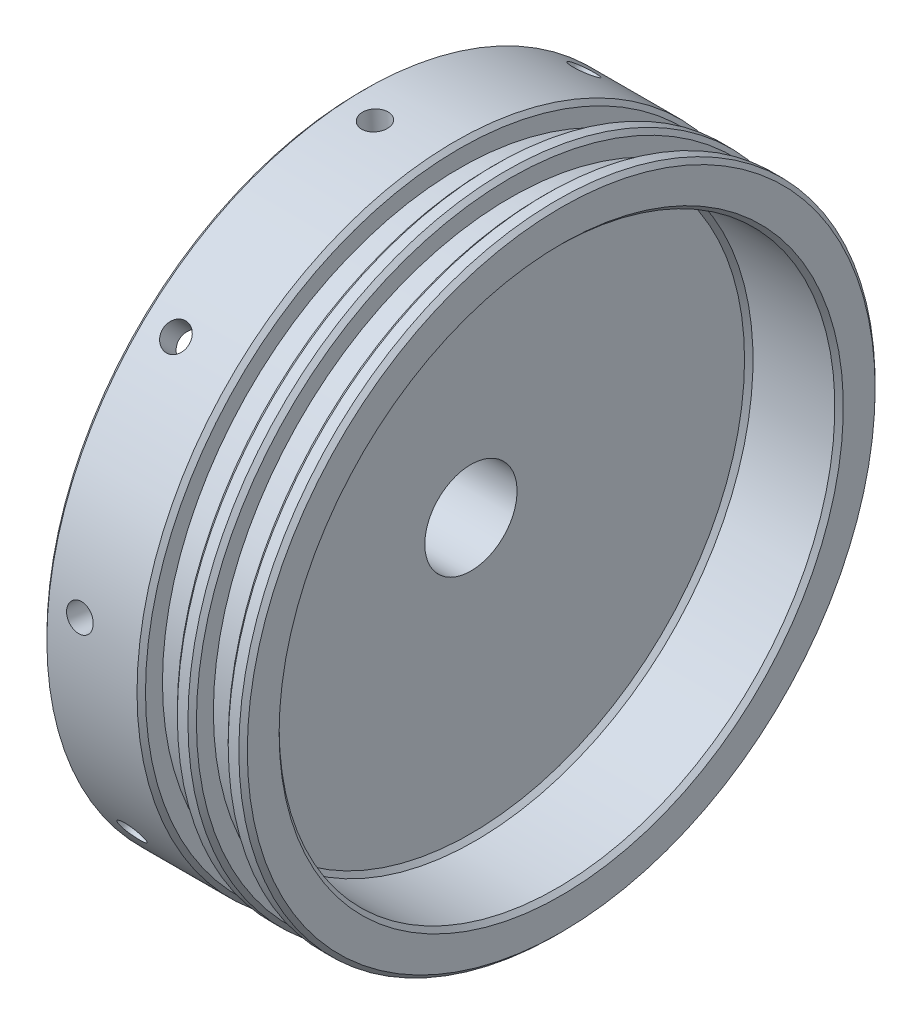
from build123d import *

# Parameters (mm, degrees)
CHAMFER1_SIZE     = 0.4
CIRPATTERN1_COUNT = 9


with BuildPart() as part:
    # Sketch2 → Revolve1 (revolve)
    with BuildSketch(Plane(origin=(0, 0, 0), x_dir=(1, 0, 0), z_dir=(0, 1, 0)), mode=Mode.PRIVATE) as revolve1_sk:
        Polygon((0, 30), (9.3, 30), (9.3, 28), (12.3, 28), (12.3, 30), (14.1, 30), (14.1, 28), (17.1, 28), (17.1, 30), (18.9, 30), (18.9, 26.2), (10.386393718, 26.2), (10.386393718, 4.35), (3.3, 4.35), (3.3, 7.6), (7.2, 7.6), (7.2, 27.75), (0, 27.75), align=None)
    revolve(revolve1_sk.sketch.rotate(Axis((0, 0, 0), (1, 0, 0)), 180), axis=Axis((0, 0, 0), (1, 0, 0)))

    # Chamfer1
    chamfer1_edges = [part.edges().sort_by_distance(p)[0] for p in [
        (0, 0, -30),
        (9.3, 0, -30),
        (12.3, 0, -30),
        (14.1, 0, -30),
        (17.1, 0, -30),
        (18.9, 0, -30),
        (18.9, 0, -26.2),
        (10.386393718, 0, -26.2),
        (0, 0, -27.75),
    ]]
    chamfer(chamfer1_edges, length=CHAMFER1_SIZE)

    # Sketch4 → M3x0.5 Tapped Hole1 (revolve, cut)
    with BuildSketch(Plane(origin=(3.34, 3.223790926, 29.826283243), x_dir=(0, -0.9942094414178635, 0.10745969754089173), z_dir=(1, 0, 0))):
        Polygon((0, 0), (0, 8.251075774), (1.25, 7.5), (1.25, 0), align=None)
    m3x0_5_tapped_hole1 = revolve(axis=Axis((3.34, 3.906160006, 36.139513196), (0, -0.10745969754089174, -0.9942094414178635)), mode=Mode.SUBTRACT)

    # CirPattern1: M3x0.5 Tapped Hole1 ×9 about axis
    cirpattern1_axis = Axis((0, 0, 0), (1, 0, 0))
    for i in range(1, CIRPATTERN1_COUNT):
        add(m3x0_5_tapped_hole1.rotate(cirpattern1_axis, i * 360 / CIRPATTERN1_COUNT), mode=Mode.SUBTRACT)


solid = part.part
